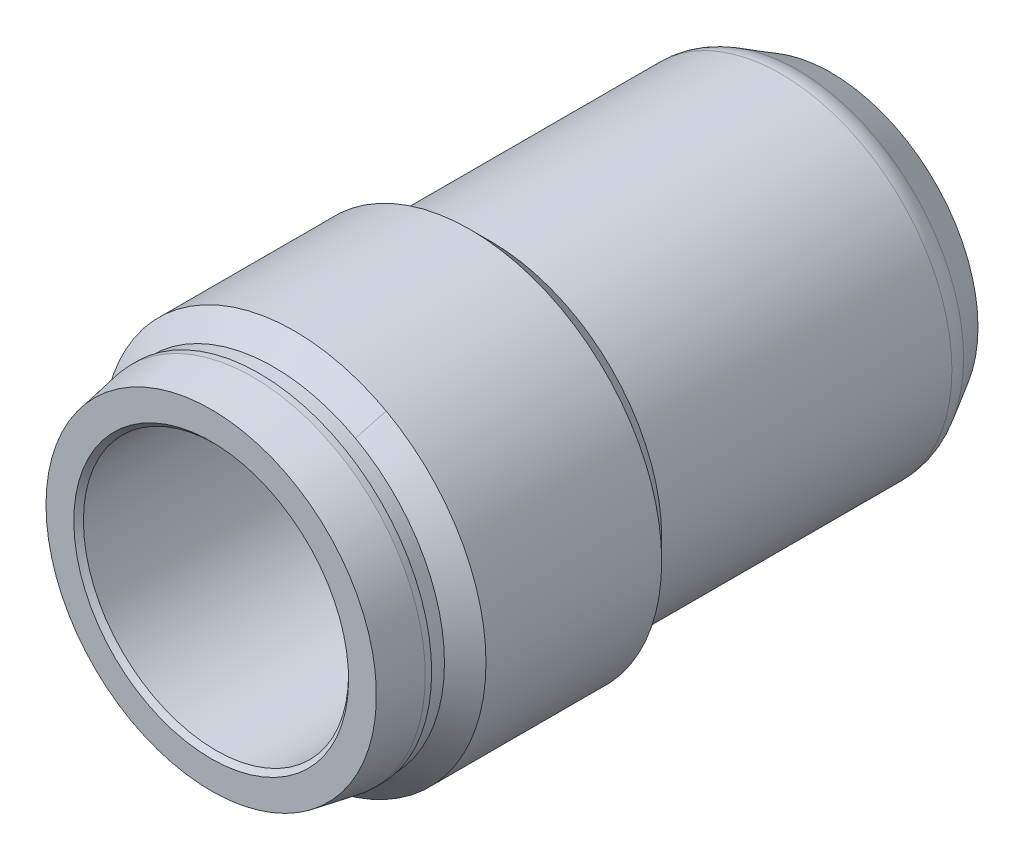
ISO-10303-21;
HEADER;
FILE_DESCRIPTION(('STEP AP214'),'2;1');
FILE_NAME('part.step','',(''),(''),'','','');
FILE_SCHEMA(('AUTOMOTIVE_DESIGN { 1 0 10303 214 1 1 1 1 }'));
ENDSEC;
DATA;
#1=APPLICATION_CONTEXT('core data for automotive mechanical design processes');
#2=APPLICATION_PROTOCOL_DEFINITION('international standard','automotive_design',2000,#1);
#3=PRODUCT_CONTEXT('',#1,'mechanical');
#4=PRODUCT('Part','Part','',(#3));
#5=PRODUCT_RELATED_PRODUCT_CATEGORY('part','',(#4));
#6=PRODUCT_DEFINITION_FORMATION('','',#4);
#7=PRODUCT_DEFINITION_CONTEXT('part definition',#1,'design');
#8=PRODUCT_DEFINITION('design','',#6,#7);
#9=PRODUCT_DEFINITION_SHAPE('','',#8);
#10=(LENGTH_UNIT() NAMED_UNIT(*) SI_UNIT(.MILLI.,.METRE.));
#11=(NAMED_UNIT(*) PLANE_ANGLE_UNIT() SI_UNIT($,.RADIAN.));
#12=(NAMED_UNIT(*) SI_UNIT($,.STERADIAN.) SOLID_ANGLE_UNIT());
#13=UNCERTAINTY_MEASURE_WITH_UNIT(LENGTH_MEASURE(1.E-05),#10,'distance_accuracy_value','');
#14=(GEOMETRIC_REPRESENTATION_CONTEXT(3) GLOBAL_UNCERTAINTY_ASSIGNED_CONTEXT((#13)) GLOBAL_UNIT_ASSIGNED_CONTEXT((#10,
#11,#12)) REPRESENTATION_CONTEXT('',''));
#15=CARTESIAN_POINT('',(0.,0.,0.));
#16=DIRECTION('',(0.,0.,1.));
#17=DIRECTION('',(1.,0.,0.));
#18=AXIS2_PLACEMENT_3D('',#15,#16,#17);
#19=CARTESIAN_POINT('',(0.,0.,39.3));
#20=DIRECTION('',(0.,0.,1.));
#21=DIRECTION('',(1.,0.,0.));
#22=AXIS2_PLACEMENT_3D('',#19,#20,#21);
#23=CYLINDRICAL_SURFACE('',#22,5.5);
#24=CARTESIAN_POINT('',(-5.47722557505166,0.5,32.5));
#25=CARTESIAN_POINT('',(-5.47722605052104,0.49999773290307,32.5280060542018));
#26=CARTESIAN_POINT('',(-5.47744277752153,0.497638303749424,32.5560359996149));
#27=CARTESIAN_POINT('',(-5.47828706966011,0.488253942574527,32.6113452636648));
#28=CARTESIAN_POINT('',(-5.47891550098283,0.481219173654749,32.6386228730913));
#29=CARTESIAN_POINT('',(-5.48051126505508,0.462690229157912,32.6915816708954));
#30=CARTESIAN_POINT('',(-5.4814782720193,0.451200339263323,32.7172643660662));
#31=CARTESIAN_POINT('',(-5.48364180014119,0.424094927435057,32.7663245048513));
#32=CARTESIAN_POINT('',(-5.48483821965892,0.408481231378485,32.7897029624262));
#33=CARTESIAN_POINT('',(-5.48733011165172,0.373517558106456,32.8335769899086));
#34=CARTESIAN_POINT('',(-5.48862585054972,0.354157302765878,32.8540643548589));
#35=CARTESIAN_POINT('',(-5.49116800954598,0.312271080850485,32.8915046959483));
#36=CARTESIAN_POINT('',(-5.49241442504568,0.289744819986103,32.9084573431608));
#37=CARTESIAN_POINT('',(-5.4947198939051,0.242119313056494,32.9383723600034));
#38=CARTESIAN_POINT('',(-5.49577862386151,0.217015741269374,32.9513278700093));
#39=CARTESIAN_POINT('',(-5.49758666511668,0.164978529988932,32.9728368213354));
#40=CARTESIAN_POINT('',(-5.49833598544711,0.138044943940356,32.9813903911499));
#41=CARTESIAN_POINT('',(-5.49943899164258,0.0831914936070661,32.9938298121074));
#42=CARTESIAN_POINT('',(-5.49979377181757,0.0552745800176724,32.9977285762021));
#43=CARTESIAN_POINT('',(-5.50007143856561,-0.000819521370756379,33.0007876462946));
#44=CARTESIAN_POINT('',(-5.49999433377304,-0.0289967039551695,32.9999480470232));
#45=CARTESIAN_POINT('',(-5.49941781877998,-0.0847235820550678,32.9935647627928));
#46=CARTESIAN_POINT('',(-5.49891965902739,-0.112274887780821,32.9880350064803));
#47=CARTESIAN_POINT('',(-5.49755847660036,-0.166056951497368,32.9724499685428));
#48=CARTESIAN_POINT('',(-5.49669544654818,-0.192287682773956,32.9623945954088));
#49=CARTESIAN_POINT('',(-5.49469940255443,-0.242728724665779,32.938027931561));
#50=CARTESIAN_POINT('',(-5.49356598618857,-0.26693595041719,32.9237102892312));
#51=CARTESIAN_POINT('',(-5.49115658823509,-0.312606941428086,32.8912314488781));
#52=CARTESIAN_POINT('',(-5.4898806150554,-0.33407086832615,32.8730704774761));
#53=CARTESIAN_POINT('',(-5.48732411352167,-0.37372596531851,32.8333455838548));
#54=CARTESIAN_POINT('',(-5.48604358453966,-0.39190566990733,32.8117702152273));
#55=CARTESIAN_POINT('',(-5.48362607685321,-0.42439545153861,32.7658563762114));
#56=CARTESIAN_POINT('',(-5.4824891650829,-0.438703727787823,32.7415166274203));
#57=CARTESIAN_POINT('',(-5.48048728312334,-0.463043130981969,32.6907478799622));
#58=CARTESIAN_POINT('',(-5.47962258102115,-0.473070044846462,32.6643168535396));
#59=CARTESIAN_POINT('',(-5.47826720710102,-0.488517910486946,32.6101801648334));
#60=CARTESIAN_POINT('',(-5.47777574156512,-0.493948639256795,32.5824773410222));
#61=CARTESIAN_POINT('',(-5.47731647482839,-0.49900539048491,32.5364280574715));
#62=CARTESIAN_POINT('',(-5.47722526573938,-0.500001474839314,32.5182190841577));
#63=CARTESIAN_POINT('',(-5.47722605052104,-0.49999773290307,32.4719939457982));
#64=CARTESIAN_POINT('',(-5.47744277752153,-0.497638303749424,32.4439640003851));
#65=CARTESIAN_POINT('',(-5.47828706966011,-0.488253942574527,32.3886547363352));
#66=CARTESIAN_POINT('',(-5.47891550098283,-0.481219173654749,32.3613771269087));
#67=CARTESIAN_POINT('',(-5.48051126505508,-0.462690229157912,32.3084183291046));
#68=CARTESIAN_POINT('',(-5.4814782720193,-0.451200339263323,32.2827356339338));
#69=CARTESIAN_POINT('',(-5.48364180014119,-0.424094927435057,32.2336754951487));
#70=CARTESIAN_POINT('',(-5.48483821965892,-0.408481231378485,32.2102970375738));
#71=CARTESIAN_POINT('',(-5.48733011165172,-0.373517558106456,32.1664230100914));
#72=CARTESIAN_POINT('',(-5.48862585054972,-0.354157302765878,32.1459356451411));
#73=CARTESIAN_POINT('',(-5.49116800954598,-0.312271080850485,32.1084953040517));
#74=CARTESIAN_POINT('',(-5.49241442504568,-0.289744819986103,32.0915426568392));
#75=CARTESIAN_POINT('',(-5.4947198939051,-0.242119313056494,32.0616276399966));
#76=CARTESIAN_POINT('',(-5.49577862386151,-0.217015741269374,32.0486721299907));
#77=CARTESIAN_POINT('',(-5.49758666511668,-0.164978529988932,32.0271631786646));
#78=CARTESIAN_POINT('',(-5.49833598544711,-0.138044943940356,32.0186096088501));
#79=CARTESIAN_POINT('',(-5.49943899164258,-0.083191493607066,32.0061701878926));
#80=CARTESIAN_POINT('',(-5.49979377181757,-0.0552745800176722,32.0022714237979));
#81=CARTESIAN_POINT('',(-5.50007143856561,0.000819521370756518,31.9992123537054));
#82=CARTESIAN_POINT('',(-5.49999433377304,0.0289967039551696,32.0000519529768));
#83=CARTESIAN_POINT('',(-5.49941781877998,0.0847235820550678,32.0064352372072));
#84=CARTESIAN_POINT('',(-5.49891965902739,0.112274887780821,32.0119649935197));
#85=CARTESIAN_POINT('',(-5.49755847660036,0.166056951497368,32.0275500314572));
#86=CARTESIAN_POINT('',(-5.49669544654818,0.192287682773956,32.0376054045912));
#87=CARTESIAN_POINT('',(-5.49469940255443,0.242728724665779,32.061972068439));
#88=CARTESIAN_POINT('',(-5.49356598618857,0.26693595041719,32.0762897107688));
#89=CARTESIAN_POINT('',(-5.49115658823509,0.312606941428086,32.1087685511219));
#90=CARTESIAN_POINT('',(-5.4898806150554,0.33407086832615,32.1269295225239));
#91=CARTESIAN_POINT('',(-5.48732411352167,0.37372596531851,32.1666544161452));
#92=CARTESIAN_POINT('',(-5.48604358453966,0.39190566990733,32.1882297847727));
#93=CARTESIAN_POINT('',(-5.48362607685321,0.42439545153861,32.2341436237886));
#94=CARTESIAN_POINT('',(-5.4824891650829,0.438703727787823,32.2584833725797));
#95=CARTESIAN_POINT('',(-5.48048728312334,0.463043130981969,32.3092521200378));
#96=CARTESIAN_POINT('',(-5.47962258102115,0.473070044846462,32.3356831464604));
#97=CARTESIAN_POINT('',(-5.47826720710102,0.488517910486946,32.3898198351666));
#98=CARTESIAN_POINT('',(-5.47777574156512,0.493948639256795,32.4175226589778));
#99=CARTESIAN_POINT('',(-5.47731647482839,0.49900539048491,32.4635719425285));
#100=CARTESIAN_POINT('',(-5.47722526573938,0.500001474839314,32.4817809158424));
#101=CARTESIAN_POINT('',(-5.47722557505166,0.5,32.5));
#102=B_SPLINE_CURVE_WITH_KNOTS('',3,(#24,#25,#26,#27,#28,#29,#30,#31,#32,#33,#34,#35,#36,#37,
#38,#39,#40,#41,#42,#43,#44,#45,#46,#47,#48,#49,#50,#51,#52,#53,#54,#55,#56,#57,#58,#59,#60,#61,
#62,#63,#64,#65,#66,#67,#68,#69,#70,#71,#72,#73,#74,#75,#76,#77,#78,#79,#80,#81,#82,#83,#84,#85,
#86,#87,#88,#89,#90,#91,#92,#93,#94,#95,#96,#97,#98,#99,#100,#101),.UNSPECIFIED.,.T.,.F.,(4,2,2,
2,2,2,2,2,2,2,2,2,2,2,2,2,2,2,2,2,2,2,2,2,2,2,2,2,2,2,2,2,2,2,2,2,2,2,4),(0.,0.0839603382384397,
0.168097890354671,0.25215470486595,0.336174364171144,0.420427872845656,0.504689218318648,
0.58909437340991,0.673497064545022,0.757665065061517,0.841831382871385,0.925748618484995,
1.00966755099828,1.09371217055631,1.17775183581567,1.26207944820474,1.34644621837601,
1.43089581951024,1.51516532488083,1.56978496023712,1.65374529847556,1.73788285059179,
1.82193966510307,1.90595932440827,1.99021283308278,2.07447417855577,2.15887933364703,
2.24328202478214,2.32745002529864,2.41161634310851,2.49553357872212,2.57945251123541,
2.66349713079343,2.74753679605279,2.83186440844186,2.91623117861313,3.00068077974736,
3.08495028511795,3.13956992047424),.UNSPECIFIED.);
#103=CARTESIAN_POINT('',(-5.47722557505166,0.5,32.5));
#104=VERTEX_POINT('',#103);
#105=EDGE_CURVE('E21',#104,#104,#102,.T.);
#106=ORIENTED_EDGE('',*,*,#105,.F.);
#107=EDGE_LOOP('',(#106));
#108=FACE_BOUND('',#107,.T.);
#109=ADVANCED_FACE('F17',(#108),#23,.T.);
#110=CARTESIAN_POINT('',(0.,0.,40.8999999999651));
#111=DIRECTION('',(0.,0.,1.));
#112=DIRECTION('',(1.,0.,0.));
#113=AXIS2_PLACEMENT_3D('',#110,#111,#112);
#114=CONICAL_SURFACE('',#113,5.99999999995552,0.785398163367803);
#115=CARTESIAN_POINT('',(0.,0.,40.25));
#116=DIRECTION('',(0.,0.,1.));
#117=DIRECTION('',(1.,0.,0.));
#118=AXIS2_PLACEMENT_3D('',#115,#116,#117);
#119=CIRCLE('',#118,5.35);
#120=CARTESIAN_POINT('',(5.35,0.,40.25));
#121=VERTEX_POINT('',#120);
#122=EDGE_CURVE('E89',#121,#121,#119,.F.);
#123=ORIENTED_EDGE('',*,*,#122,.F.);
#124=EDGE_LOOP('',(#123));
#125=FACE_BOUND('',#124,.T.);
#126=CARTESIAN_POINT('',(0.,0.,40.9));
#127=DIRECTION('',(0.,0.,1.));
#128=DIRECTION('',(1.,0.,0.));
#129=AXIS2_PLACEMENT_3D('',#126,#127,#128);
#130=CIRCLE('',#129,6.);
#131=CARTESIAN_POINT('',(6.,0.,40.9));
#132=VERTEX_POINT('',#131);
#133=EDGE_CURVE('E85',#132,#132,#130,.T.);
#134=ORIENTED_EDGE('',*,*,#133,.F.);
#135=EDGE_LOOP('',(#134));
#136=FACE_BOUND('',#135,.T.);
#137=ADVANCED_FACE('F150',(#125,#136),#114,.T.);
#138=CARTESIAN_POINT('',(-3.66000000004,0.,32.5));
#139=DIRECTION('',(-1.,0.,0.));
#140=DIRECTION('',(0.,0.,1.));
#141=AXIS2_PLACEMENT_3D('',#138,#139,#140);
#142=CYLINDRICAL_SURFACE('',#141,0.5);
#143=ORIENTED_EDGE('',*,*,#105,.T.);
#144=EDGE_LOOP('',(#143));
#145=FACE_BOUND('',#144,.T.);
#146=CARTESIAN_POINT('',(-5.32658427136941,0.5,32.5));
#147=CARTESIAN_POINT('',(-5.32658475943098,0.49999773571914,32.5280024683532));
#148=CARTESIAN_POINT('',(-5.32680755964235,0.497638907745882,32.5560287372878));
#149=CARTESIAN_POINT('',(-5.32767549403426,0.488257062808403,32.6113305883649));
#150=CARTESIAN_POINT('',(-5.32832151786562,0.481224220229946,32.6386044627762));
#151=CARTESIAN_POINT('',(-5.32996191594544,0.462700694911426,32.6915557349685));
#152=CARTESIAN_POINT('',(-5.33095595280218,0.451214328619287,32.7172346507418));
#153=CARTESIAN_POINT('',(-5.33317992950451,0.424117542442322,32.7662879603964));
#154=CARTESIAN_POINT('',(-5.33440976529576,0.408508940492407,32.7896633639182));
#155=CARTESIAN_POINT('',(-5.33697146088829,0.373554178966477,32.8335358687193));
#156=CARTESIAN_POINT('',(-5.33830360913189,0.354197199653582,32.8540243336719));
#157=CARTESIAN_POINT('',(-5.34091725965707,0.312317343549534,32.89146769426));
#158=CARTESIAN_POINT('',(-5.34219875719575,0.289794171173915,32.908422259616));
#159=CARTESIAN_POINT('',(-5.34456933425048,0.242171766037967,32.9383434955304));
#160=CARTESIAN_POINT('',(-5.34565806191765,0.217067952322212,32.9513029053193));
#161=CARTESIAN_POINT('',(-5.34751742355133,0.165028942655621,32.9728193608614));
#162=CARTESIAN_POINT('',(-5.34828806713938,0.138093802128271,32.9813765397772));
#163=CARTESIAN_POINT('',(-5.34942248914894,0.0832404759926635,32.9938214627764));
#164=CARTESIAN_POINT('',(-5.34978745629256,0.0553254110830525,32.9977228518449));
#165=CARTESIAN_POINT('',(-5.350073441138,-0.000765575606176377,33.0007876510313));
#166=CARTESIAN_POINT('',(-5.34999446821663,-0.0289414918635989,32.9999511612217));
#167=CARTESIAN_POINT('',(-5.34940244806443,-0.0846614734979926,32.9935750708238));
#168=CARTESIAN_POINT('',(-5.34889075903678,-0.112207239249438,32.9880501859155));
#169=CARTESIAN_POINT('',(-5.34749238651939,-0.165979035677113,32.9724769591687));
#170=CARTESIAN_POINT('',(-5.34660569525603,-0.192205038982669,32.9624285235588));
#171=CARTESIAN_POINT('',(-5.34455466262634,-0.242639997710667,32.9380767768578));
#172=CARTESIAN_POINT('',(-5.34338988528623,-0.266845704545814,32.9237667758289));
#173=CARTESIAN_POINT('',(-5.34091359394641,-0.312515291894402,32.8913042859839));
#174=CARTESIAN_POINT('',(-5.33960208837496,-0.333979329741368,32.8731520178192));
#175=CARTESIAN_POINT('',(-5.33697384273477,-0.373640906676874,32.8334409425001));
#176=CARTESIAN_POINT('',(-5.33565710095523,-0.39182629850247,32.8118700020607));
#177=CARTESIAN_POINT('',(-5.33317093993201,-0.424328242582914,32.7659636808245));
#178=CARTESIAN_POINT('',(-5.33200158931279,-0.43864299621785,32.7416270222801));
#179=CARTESIAN_POINT('',(-5.32994228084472,-0.462996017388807,32.690862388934));
#180=CARTESIAN_POINT('',(-5.32905260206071,-0.473030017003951,32.6644323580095));
#181=CARTESIAN_POINT('',(-5.32765775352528,-0.488491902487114,32.610295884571));
#182=CARTESIAN_POINT('',(-5.32715176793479,-0.493929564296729,32.5825922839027));
#183=CARTESIAN_POINT('',(-5.32667813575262,-0.499001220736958,32.5365041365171));
#184=CARTESIAN_POINT('',(-5.3265839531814,-0.500001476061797,32.5182571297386));
#185=CARTESIAN_POINT('',(-5.32658475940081,-0.499997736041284,32.4719975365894));
#186=CARTESIAN_POINT('',(-5.32680755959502,-0.497638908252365,32.4439712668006));
#187=CARTESIAN_POINT('',(-5.32767549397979,-0.488257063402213,32.3886694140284));
#188=CARTESIAN_POINT('',(-5.32832151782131,-0.481224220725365,32.3613955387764));
#189=CARTESIAN_POINT('',(-5.32996191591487,-0.46270069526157,32.3084442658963));
#190=CARTESIAN_POINT('',(-5.33095595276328,-0.451214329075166,32.282765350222));
#191=CARTESIAN_POINT('',(-5.33317992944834,-0.424117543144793,32.2337120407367));
#192=CARTESIAN_POINT('',(-5.33440976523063,-0.408508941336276,32.2103366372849));
#193=CARTESIAN_POINT('',(-5.33697146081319,-0.373554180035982,32.1664641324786));
#194=CARTESIAN_POINT('',(-5.33830360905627,-0.35419720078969,32.1459756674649));
#195=CARTESIAN_POINT('',(-5.34091725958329,-0.312317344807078,32.1085323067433));
#196=CARTESIAN_POINT('',(-5.34219875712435,-0.289794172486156,32.0915777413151));
#197=CARTESIAN_POINT('',(-5.34456933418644,-0.242171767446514,32.0616565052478));
#198=CARTESIAN_POINT('',(-5.3456580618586,-0.217067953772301,32.0486970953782));
#199=CARTESIAN_POINT('',(-5.34751742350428,-0.165028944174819,32.0271806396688));
#200=CARTESIAN_POINT('',(-5.34828806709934,-0.138093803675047,32.0186234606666));
#201=CARTESIAN_POINT('',(-5.34942248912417,-0.0832404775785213,32.0061785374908));
#202=CARTESIAN_POINT('',(-5.34978745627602,-0.0553254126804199,32.0022771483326));
#203=CARTESIAN_POINT('',(-5.35007344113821,0.000765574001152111,31.9992123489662));
#204=CARTESIAN_POINT('',(-5.34999446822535,0.0289414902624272,32.0000488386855));
#205=CARTESIAN_POINT('',(-5.34940244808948,0.0846614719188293,32.0064249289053));
#206=CARTESIAN_POINT('',(-5.34889075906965,0.1122072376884,32.0119498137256));
#207=CARTESIAN_POINT('',(-5.3474923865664,0.165979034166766,32.0275230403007));
#208=CARTESIAN_POINT('',(-5.34660569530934,0.192205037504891,32.037571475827));
#209=CARTESIAN_POINT('',(-5.34455466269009,0.242639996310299,32.0619232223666));
#210=CARTESIAN_POINT('',(-5.34338988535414,0.266845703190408,32.0762332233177));
#211=CARTESIAN_POINT('',(-5.34091359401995,0.31251529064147,32.1086957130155));
#212=CARTESIAN_POINT('',(-5.33960208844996,0.333979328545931,32.1268479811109));
#213=CARTESIAN_POINT('',(-5.33697384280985,0.373640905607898,32.1665590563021));
#214=CARTESIAN_POINT('',(-5.33565710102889,0.391826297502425,32.1881299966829));
#215=CARTESIAN_POINT('',(-5.33317094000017,0.424328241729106,32.2340363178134));
#216=CARTESIAN_POINT('',(-5.33200158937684,0.438642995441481,32.2583729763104));
#217=CARTESIAN_POINT('',(-5.32994228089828,0.462996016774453,32.3091376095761));
#218=CARTESIAN_POINT('',(-5.32905260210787,0.473030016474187,32.3355676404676));
#219=CARTESIAN_POINT('',(-5.32765775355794,0.488491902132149,32.3897041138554));
#220=CARTESIAN_POINT('',(-5.3271517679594,0.493929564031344,32.4174077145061));
#221=CARTESIAN_POINT('',(-5.32667813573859,0.499001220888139,32.4634958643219));
#222=CARTESIAN_POINT('',(-5.32658395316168,0.500001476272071,32.4817428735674));
#223=CARTESIAN_POINT('',(-5.32658427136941,0.5,32.5));
#224=B_SPLINE_CURVE_WITH_KNOTS('',3,(#146,#147,#148,#149,#150,#151,#152,#153,#154,#155,#156,
#157,#158,#159,#160,#161,#162,#163,#164,#165,#166,#167,#168,#169,#170,#171,#172,#173,#174,#175,
#176,#177,#178,#179,#180,#181,#182,#183,#184,#185,#186,#187,#188,#189,#190,#191,#192,#193,#194,
#195,#196,#197,#198,#199,#200,#201,#202,#203,#204,#205,#206,#207,#208,#209,#210,#211,#212,#213,
#214,#215,#216,#217,#218,#219,#220,#221,#222,#223),.UNSPECIFIED.,.T.,.F.,(4,2,2,2,2,2,2,2,2,2,2,
2,2,2,2,2,2,2,2,2,2,2,2,2,2,2,2,2,2,2,2,2,2,2,2,2,2,2,4),(0.,0.0839494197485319,
0.168075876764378,0.252120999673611,0.336129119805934,0.420383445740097,0.50464564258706,
0.589060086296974,0.67347197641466,0.757635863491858,0.84179797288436,0.925696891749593,
1.00959754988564,1.09363061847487,1.17765886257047,1.26199230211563,1.34636486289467,
1.43082134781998,1.51509774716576,1.56983131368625,1.65378073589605,1.73790719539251,
1.82195231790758,1.90596043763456,1.99021476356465,2.07447696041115,2.15889140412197,
2.24330329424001,2.32746718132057,2.41162929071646,2.49552820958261,2.57942886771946,
2.66346193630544,2.74749018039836,2.83182361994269,2.91619618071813,3.00065266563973,
3.08492906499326,3.13966263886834),.UNSPECIFIED.);
#225=CARTESIAN_POINT('',(-5.32658427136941,0.5,32.5));
#226=VERTEX_POINT('',#225);
#227=EDGE_CURVE('E59',#226,#226,#224,.T.);
#228=ORIENTED_EDGE('',*,*,#227,.F.);
#229=EDGE_LOOP('',(#228));
#230=FACE_BOUND('',#229,.T.);
#231=ADVANCED_FACE('F136',(#145,#230),#142,.T.);
#232=CARTESIAN_POINT('',(0.,0.,39.3));
#233=DIRECTION('',(0.,0.,1.));
#234=DIRECTION('',(1.,0.,0.));
#235=AXIS2_PLACEMENT_3D('',#232,#233,#234);
#236=CYLINDRICAL_SURFACE('',#235,6.);
#237=CARTESIAN_POINT('',(0.,0.,46.3999999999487));
#238=DIRECTION('',(0.,0.,-1.));
#239=DIRECTION('',(0.47942553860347,0.877582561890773,0.));
#240=AXIS2_PLACEMENT_3D('',#237,#238,#239);
#241=CIRCLE('',#240,6.00000000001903);
#242=CARTESIAN_POINT('',(2.876553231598,5.26549537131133,46.4000000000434));
#243=VERTEX_POINT('',#242);
#244=CARTESIAN_POINT('',(-2.87655323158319,-5.26549537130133,46.4000000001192));
#245=VERTEX_POINT('',#244);
#246=EDGE_CURVE('E49',#243,#245,#241,.F.);
#247=ORIENTED_EDGE('',*,*,#246,.F.);
#248=CARTESIAN_POINT('',(0.,0.,46.4000000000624));
#249=DIRECTION('',(0.,0.,-1.));
#250=DIRECTION('',(0.479425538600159,0.877582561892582,0.));
#251=AXIS2_PLACEMENT_3D('',#248,#249,#250);
#252=CIRCLE('',#251,5.99999999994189);
#253=EDGE_CURVE('E56',#245,#243,#252,.F.);
#254=ORIENTED_EDGE('',*,*,#253,.F.);
#255=EDGE_LOOP('',(#247,#254));
#256=FACE_BOUND('',#255,.T.);
#257=ORIENTED_EDGE('',*,*,#133,.T.);
#258=EDGE_LOOP('',(#257));
#259=FACE_BOUND('',#258,.T.);
#260=ADVANCED_FACE('F54',(#256,#259),#236,.T.);
#261=CARTESIAN_POINT('',(0.,0.,39.3));
#262=DIRECTION('',(0.,0.,1.));
#263=DIRECTION('',(1.,0.,0.));
#264=AXIS2_PLACEMENT_3D('',#261,#262,#263);
#265=CYLINDRICAL_SURFACE('',#264,5.35);
#266=CARTESIAN_POINT('',(0.,0.,31.1669872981));
#267=DIRECTION('',(0.,0.,1.));
#268=DIRECTION('',(0.479425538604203,0.877582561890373,0.));
#269=AXIS2_PLACEMENT_3D('',#266,#267,#268);
#270=CIRCLE('',#269,5.35);
#271=CARTESIAN_POINT('',(2.56492663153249,4.69506670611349,31.1669872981));
#272=VERTEX_POINT('',#271);
#273=EDGE_CURVE('E66',#272,#272,#270,.F.);
#274=ORIENTED_EDGE('',*,*,#273,.F.);
#275=EDGE_LOOP('',(#274));
#276=FACE_BOUND('',#275,.T.);
#277=ORIENTED_EDGE('',*,*,#227,.T.);
#278=EDGE_LOOP('',(#277));
#279=FACE_BOUND('',#278,.T.);
#280=ORIENTED_EDGE('',*,*,#122,.T.);
#281=EDGE_LOOP('',(#280));
#282=FACE_BOUND('',#281,.T.);
#283=ADVANCED_FACE('F139',(#276,#279,#282),#265,.T.);
#284=CARTESIAN_POINT('',(0.,0.,46.4000000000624));
#285=DIRECTION('',(0.,0.,-1.));
#286=DIRECTION('',(-1.,0.,0.));
#287=AXIS2_PLACEMENT_3D('',#284,#285,#286);
#288=CONICAL_SURFACE('',#287,5.99999999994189,0.785398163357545);
#289=DIRECTION('',(0.339005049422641,0.620544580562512,0.707106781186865));
#290=VECTOR('',#289,1.);
#291=CARTESIAN_POINT('',(-239258.46566274,-437959.683708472,-499000.));
#292=LINE('',#291,#290);
#293=CARTESIAN_POINT('',(-2.56492663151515,-4.69506670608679,47.0500000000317));
#294=VERTEX_POINT('',#293);
#295=EDGE_CURVE('E64',#294,#245,#292,.F.);
#296=ORIENTED_EDGE('',*,*,#295,.F.);
#297=CARTESIAN_POINT('',(0.,0.,47.05));
#298=DIRECTION('',(0.,0.,1.));
#299=DIRECTION('',(1.,0.,0.));
#300=AXIS2_PLACEMENT_3D('',#297,#298,#299);
#301=CIRCLE('',#300,5.35);
#302=CARTESIAN_POINT('',(2.56492663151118,4.69506670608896,47.0500000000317));
#303=VERTEX_POINT('',#302);
#304=EDGE_CURVE('E40',#303,#294,#301,.T.);
#305=ORIENTED_EDGE('',*,*,#304,.F.);
#306=DIRECTION('',(-0.339005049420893,-0.620544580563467,0.707106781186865));
#307=VECTOR('',#306,1.);
#308=CARTESIAN_POINT('',(239258.465661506,437959.683709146,-499000.));
#309=LINE('',#308,#307);
#310=EDGE_CURVE('E58',#243,#303,#309,.T.);
#311=ORIENTED_EDGE('',*,*,#310,.F.);
#312=ORIENTED_EDGE('',*,*,#246,.T.);
#313=EDGE_LOOP('',(#296,#305,#311,#312));
#314=FACE_BOUND('',#313,.T.);
#315=ADVANCED_FACE('F68',(#314),#288,.T.);
#316=CARTESIAN_POINT('',(0.,0.,46.4000000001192));
#317=DIRECTION('',(0.,0.,-1.));
#318=DIRECTION('',(-1.,0.,0.));
#319=AXIS2_PLACEMENT_3D('',#316,#317,#318);
#320=CONICAL_SURFACE('',#319,5.99999999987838,0.785398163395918);
#321=ORIENTED_EDGE('',*,*,#295,.T.);
#322=ORIENTED_EDGE('',*,*,#253,.T.);
#323=ORIENTED_EDGE('',*,*,#310,.T.);
#324=CARTESIAN_POINT('',(0.,0.,47.05));
#325=DIRECTION('',(0.,0.,1.));
#326=DIRECTION('',(1.,0.,0.));
#327=AXIS2_PLACEMENT_3D('',#324,#325,#326);
#328=CIRCLE('',#327,5.35);
#329=EDGE_CURVE('E222',#294,#303,#328,.T.);
#330=ORIENTED_EDGE('',*,*,#329,.F.);
#331=EDGE_LOOP('',(#321,#322,#323,#330));
#332=FACE_BOUND('',#331,.T.);
#333=ADVANCED_FACE('F62',(#332),#320,.T.);
#334=CARTESIAN_POINT('',(0.,0.,31.1669872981));
#335=DIRECTION('',(0.,0.,1.));
#336=DIRECTION('',(0.479425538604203,0.877582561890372,0.));
#337=AXIS2_PLACEMENT_3D('',#334,#335,#336);
#338=TOROIDAL_SURFACE('',#337,4.35,1.);
#339=ORIENTED_EDGE('',*,*,#273,.T.);
#340=EDGE_LOOP('',(#339));
#341=FACE_BOUND('',#340,.T.);
#342=CARTESIAN_POINT('',(0.,0.,30.6669872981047));
#343=DIRECTION('',(0.,0.,1.));
#344=DIRECTION('',(0.479425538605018,0.877582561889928,0.));
#345=AXIS2_PLACEMENT_3D('',#342,#343,#344);
#346=CIRCLE('',#345,5.21602540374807);
#347=CARTESIAN_POINT('',(2.50069578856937,4.57749293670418,30.6669872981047));
#348=VERTEX_POINT('',#347);
#349=EDGE_CURVE('E129',#348,#348,#346,.F.);
#350=ORIENTED_EDGE('',*,*,#349,.F.);
#351=EDGE_LOOP('',(#350));
#352=FACE_BOUND('',#351,.T.);
#353=ADVANCED_FACE('F208',(#341,#352),#338,.T.);
#354=CARTESIAN_POINT('',(0.,0.,39.3));
#355=DIRECTION('',(0.,0.,1.));
#356=DIRECTION('',(1.,0.,0.));
#357=AXIS2_PLACEMENT_3D('',#354,#355,#356);
#358=CYLINDRICAL_SURFACE('',#357,5.35);
#359=CARTESIAN_POINT('',(0.,0.,47.5));
#360=DIRECTION('',(0.,0.,1.));
#361=DIRECTION('',(1.,0.,0.));
#362=AXIS2_PLACEMENT_3D('',#359,#360,#361);
#363=CIRCLE('',#362,5.35);
#364=CARTESIAN_POINT('',(5.35,0.,47.5));
#365=VERTEX_POINT('',#364);
#366=EDGE_CURVE('E126',#365,#365,#363,.T.);
#367=ORIENTED_EDGE('',*,*,#366,.F.);
#368=EDGE_LOOP('',(#367));
#369=FACE_BOUND('',#368,.T.);
#370=ORIENTED_EDGE('',*,*,#329,.T.);
#371=ORIENTED_EDGE('',*,*,#304,.T.);
#372=EDGE_LOOP('',(#370,#371));
#373=FACE_BOUND('',#372,.T.);
#374=ADVANCED_FACE('F204',(#369,#373),#358,.T.);
#375=CARTESIAN_POINT('',(0.,0.,30.666987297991));
#376=DIRECTION('',(0.,0.,1.));
#377=DIRECTION('',(1.,0.,0.));
#378=AXIS2_PLACEMENT_3D('',#375,#376,#377);
#379=CONICAL_SURFACE('',#378,5.21602540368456,0.523598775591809);
#380=ORIENTED_EDGE('',*,*,#349,.T.);
#381=EDGE_LOOP('',(#380));
#382=FACE_BOUND('',#381,.T.);
#383=CARTESIAN_POINT('',(0.,0.,29.6000000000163));
#384=DIRECTION('',(0.,0.,1.));
#385=DIRECTION('',(1.,0.,0.));
#386=AXIS2_PLACEMENT_3D('',#383,#384,#385);
#387=CIRCLE('',#386,4.59999999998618);
#388=CARTESIAN_POINT('',(4.59999999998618,0.,29.6000000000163));
#389=VERTEX_POINT('',#388);
#390=EDGE_CURVE('E122',#389,#389,#387,.F.);
#391=ORIENTED_EDGE('',*,*,#390,.F.);
#392=EDGE_LOOP('',(#391));
#393=FACE_BOUND('',#392,.T.);
#394=ADVANCED_FACE('F200',(#382,#393),#379,.T.);
#395=CARTESIAN_POINT('',(0.,5.35,47.5));
#396=DIRECTION('',(0.,0.,-1.));
#397=DIRECTION('',(-1.,0.,0.));
#398=AXIS2_PLACEMENT_3D('',#395,#396,#397);
#399=PLANE('',#398);
#400=ORIENTED_EDGE('',*,*,#366,.T.);
#401=EDGE_LOOP('',(#400));
#402=FACE_BOUND('',#401,.T.);
#403=CARTESIAN_POINT('',(0.,0.,47.5));
#404=DIRECTION('',(0.,0.,1.));
#405=DIRECTION('',(1.,0.,0.));
#406=AXIS2_PLACEMENT_3D('',#403,#404,#405);
#407=CIRCLE('',#406,5.4);
#408=CARTESIAN_POINT('',(5.4,0.,47.5));
#409=VERTEX_POINT('',#408);
#410=EDGE_CURVE('E118',#409,#409,#407,.T.);
#411=ORIENTED_EDGE('',*,*,#410,.F.);
#412=EDGE_LOOP('',(#411));
#413=FACE_BOUND('',#412,.T.);
#414=ADVANCED_FACE('F196',(#402,#413),#399,.T.);
#415=CARTESIAN_POINT('',(0.,4.6,29.6));
#416=DIRECTION('',(0.,0.,-1.));
#417=DIRECTION('',(-1.,0.,0.));
#418=AXIS2_PLACEMENT_3D('',#415,#416,#417);
#419=PLANE('',#418);
#420=CARTESIAN_POINT('',(0.,0.,29.6));
#421=DIRECTION('',(0.,0.,1.));
#422=DIRECTION('',(1.,0.,0.));
#423=AXIS2_PLACEMENT_3D('',#420,#421,#422);
#424=CIRCLE('',#423,3.56);
#425=CARTESIAN_POINT('',(3.56,0.,29.6));
#426=VERTEX_POINT('',#425);
#427=EDGE_CURVE('E114',#426,#426,#424,.T.);
#428=ORIENTED_EDGE('',*,*,#427,.T.);
#429=EDGE_LOOP('',(#428));
#430=FACE_BOUND('',#429,.T.);
#431=ORIENTED_EDGE('',*,*,#390,.T.);
#432=EDGE_LOOP('',(#431));
#433=FACE_BOUND('',#432,.T.);
#434=ADVANCED_FACE('F192',(#430,#433),#419,.T.);
#435=CARTESIAN_POINT('',(0.,0.,39.3));
#436=DIRECTION('',(0.,0.,1.));
#437=DIRECTION('',(1.,0.,0.));
#438=AXIS2_PLACEMENT_3D('',#435,#436,#437);
#439=CYLINDRICAL_SURFACE('',#438,5.4);
#440=CARTESIAN_POINT('',(0.,0.,47.7000000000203));
#441=DIRECTION('',(0.,0.,-1.));
#442=DIRECTION('',(0.479425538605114,0.877582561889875,0.));
#443=AXIS2_PLACEMENT_3D('',#440,#441,#442);
#444=CIRCLE('',#443,5.39999999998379);
#445=CARTESIAN_POINT('',(2.58889790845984,4.7389458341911,47.7000000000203));
#446=VERTEX_POINT('',#445);
#447=EDGE_CURVE('E113',#446,#446,#444,.F.);
#448=ORIENTED_EDGE('',*,*,#447,.F.);
#449=EDGE_LOOP('',(#448));
#450=FACE_BOUND('',#449,.T.);
#451=ORIENTED_EDGE('',*,*,#410,.T.);
#452=EDGE_LOOP('',(#451));
#453=FACE_BOUND('',#452,.T.);
#454=ADVANCED_FACE('F188',(#450,#453),#439,.T.);
#455=CARTESIAN_POINT('',(0.,0.,39.3));
#456=DIRECTION('',(0.,0.,1.));
#457=DIRECTION('',(1.,0.,0.));
#458=AXIS2_PLACEMENT_3D('',#455,#456,#457);
#459=CYLINDRICAL_SURFACE('',#458,3.56);
#460=ORIENTED_EDGE('',*,*,#427,.F.);
#461=EDGE_LOOP('',(#460));
#462=FACE_BOUND('',#461,.T.);
#463=CARTESIAN_POINT('',(0.,0.,34.8));
#464=DIRECTION('',(0.,0.,1.));
#465=DIRECTION('',(1.,0.,0.));
#466=AXIS2_PLACEMENT_3D('',#463,#464,#465);
#467=CIRCLE('',#466,3.56);
#468=CARTESIAN_POINT('',(3.56,0.,34.8));
#469=VERTEX_POINT('',#468);
#470=EDGE_CURVE('E109',#469,#469,#467,.T.);
#471=ORIENTED_EDGE('',*,*,#470,.T.);
#472=EDGE_LOOP('',(#471));
#473=FACE_BOUND('',#472,.T.);
#474=ADVANCED_FACE('F184',(#462,#473),#459,.F.);
#475=CARTESIAN_POINT('',(0.,0.,47.7000000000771));
#476=DIRECTION('',(0.,0.,-1.));
#477=DIRECTION('',(-1.,0.,0.));
#478=AXIS2_PLACEMENT_3D('',#475,#476,#477);
#479=CONICAL_SURFACE('',#478,5.39999999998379,0.174532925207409);
#480=CARTESIAN_POINT('',(0.,0.,48.9999999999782));
#481=DIRECTION('',(0.,0.,-1.));
#482=DIRECTION('',(-1.,0.,0.));
#483=AXIS2_PLACEMENT_3D('',#480,#481,#482);
#484=CIRCLE('',#483,5.17077492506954);
#485=CARTESIAN_POINT('',(-5.17077492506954,0.,48.9999999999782));
#486=VERTEX_POINT('',#485);
#487=EDGE_CURVE('E105',#486,#486,#484,.T.);
#488=ORIENTED_EDGE('',*,*,#487,.T.);
#489=EDGE_LOOP('',(#488));
#490=FACE_BOUND('',#489,.T.);
#491=ORIENTED_EDGE('',*,*,#447,.T.);
#492=EDGE_LOOP('',(#491));
#493=FACE_BOUND('',#492,.T.);
#494=ADVANCED_FACE('F180',(#490,#493),#479,.T.);
#495=CARTESIAN_POINT('',(0.,3.9,34.8));
#496=DIRECTION('',(0.,0.,-1.));
#497=DIRECTION('',(-1.,0.,0.));
#498=AXIS2_PLACEMENT_3D('',#495,#496,#497);
#499=PLANE('',#498);
#500=ORIENTED_EDGE('',*,*,#470,.F.);
#501=EDGE_LOOP('',(#500));
#502=FACE_BOUND('',#501,.T.);
#503=CARTESIAN_POINT('',(0.,0.,34.8));
#504=DIRECTION('',(0.,0.,1.));
#505=DIRECTION('',(1.,0.,0.));
#506=AXIS2_PLACEMENT_3D('',#503,#504,#505);
#507=CIRCLE('',#506,3.9);
#508=CARTESIAN_POINT('',(3.9,0.,34.8));
#509=VERTEX_POINT('',#508);
#510=EDGE_CURVE('E101',#509,#509,#507,.T.);
#511=ORIENTED_EDGE('',*,*,#510,.T.);
#512=EDGE_LOOP('',(#511));
#513=FACE_BOUND('',#512,.T.);
#514=ADVANCED_FACE('F176',(#502,#513),#499,.F.);
#515=CARTESIAN_POINT('',(0.,5.17077492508,49.));
#516=DIRECTION('',(0.,0.,-1.));
#517=DIRECTION('',(-1.,0.,0.));
#518=AXIS2_PLACEMENT_3D('',#515,#516,#517);
#519=PLANE('',#518);
#520=CARTESIAN_POINT('',(0.,0.,48.9999999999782));
#521=DIRECTION('',(0.,0.,1.));
#522=DIRECTION('',(0.,-1.,0.));
#523=AXIS2_PLACEMENT_3D('',#520,#521,#522);
#524=CIRCLE('',#523,4.29999999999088);
#525=CARTESIAN_POINT('',(0.,-4.29999999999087,48.9999999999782));
#526=VERTEX_POINT('',#525);
#527=EDGE_CURVE('E97',#526,#526,#524,.F.);
#528=ORIENTED_EDGE('',*,*,#527,.T.);
#529=EDGE_LOOP('',(#528));
#530=FACE_BOUND('',#529,.T.);
#531=ORIENTED_EDGE('',*,*,#487,.F.);
#532=EDGE_LOOP('',(#531));
#533=FACE_BOUND('',#532,.T.);
#534=ADVANCED_FACE('F172',(#530,#533),#519,.F.);
#535=CARTESIAN_POINT('',(0.,0.,39.3));
#536=DIRECTION('',(0.,0.,1.));
#537=DIRECTION('',(1.,0.,0.));
#538=AXIS2_PLACEMENT_3D('',#535,#536,#537);
#539=CYLINDRICAL_SURFACE('',#538,3.9);
#540=CARTESIAN_POINT('',(0.,0.,36.8));
#541=DIRECTION('',(0.,0.,1.));
#542=DIRECTION('',(1.,0.,0.));
#543=AXIS2_PLACEMENT_3D('',#540,#541,#542);
#544=CIRCLE('',#543,3.9);
#545=CARTESIAN_POINT('',(3.9,0.,36.8));
#546=VERTEX_POINT('',#545);
#547=EDGE_CURVE('E93',#546,#546,#544,.T.);
#548=ORIENTED_EDGE('',*,*,#547,.T.);
#549=EDGE_LOOP('',(#548));
#550=FACE_BOUND('',#549,.T.);
#551=ORIENTED_EDGE('',*,*,#510,.F.);
#552=EDGE_LOOP('',(#551));
#553=FACE_BOUND('',#552,.T.);
#554=ADVANCED_FACE('F168',(#550,#553),#539,.F.);
#555=CARTESIAN_POINT('',(0.,0.,48.9999999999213));
#556=DIRECTION('',(0.,0.,1.));
#557=DIRECTION('',(0.,-1.,0.));
#558=AXIS2_PLACEMENT_3D('',#555,#556,#557);
#559=CONICAL_SURFACE('',#558,4.29999999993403,0.785398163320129);
#560=CARTESIAN_POINT('',(0.,0.,48.85));
#561=DIRECTION('',(0.,0.,1.));
#562=DIRECTION('',(1.,0.,0.));
#563=AXIS2_PLACEMENT_3D('',#560,#561,#562);
#564=CIRCLE('',#563,4.15);
#565=CARTESIAN_POINT('',(4.15,0.,48.85));
#566=VERTEX_POINT('',#565);
#567=EDGE_CURVE('E32',#566,#566,#564,.F.);
#568=ORIENTED_EDGE('',*,*,#567,.T.);
#569=EDGE_LOOP('',(#568));
#570=FACE_BOUND('',#569,.T.);
#571=ORIENTED_EDGE('',*,*,#527,.F.);
#572=EDGE_LOOP('',(#571));
#573=FACE_BOUND('',#572,.T.);
#574=ADVANCED_FACE('F160',(#570,#573),#559,.F.);
#575=CARTESIAN_POINT('',(0.,3.9,36.8));
#576=DIRECTION('',(0.,0.,-1.));
#577=DIRECTION('',(-1.,0.,0.));
#578=AXIS2_PLACEMENT_3D('',#575,#576,#577);
#579=PLANE('',#578);
#580=ORIENTED_EDGE('',*,*,#547,.F.);
#581=EDGE_LOOP('',(#580));
#582=FACE_BOUND('',#581,.T.);
#583=CARTESIAN_POINT('',(0.,0.,36.8));
#584=DIRECTION('',(0.,0.,1.));
#585=DIRECTION('',(1.,0.,0.));
#586=AXIS2_PLACEMENT_3D('',#583,#584,#585);
#587=CIRCLE('',#586,4.15);
#588=CARTESIAN_POINT('',(4.15,0.,36.8));
#589=VERTEX_POINT('',#588);
#590=EDGE_CURVE('E11',#589,#589,#587,.T.);
#591=ORIENTED_EDGE('',*,*,#590,.T.);
#592=EDGE_LOOP('',(#591));
#593=FACE_BOUND('',#592,.T.);
#594=ADVANCED_FACE('F154',(#582,#593),#579,.F.);
#595=CARTESIAN_POINT('',(0.,0.,39.3));
#596=DIRECTION('',(0.,0.,1.));
#597=DIRECTION('',(1.,0.,0.));
#598=AXIS2_PLACEMENT_3D('',#595,#596,#597);
#599=CYLINDRICAL_SURFACE('',#598,4.15);
#600=ORIENTED_EDGE('',*,*,#590,.F.);
#601=EDGE_LOOP('',(#600));
#602=FACE_BOUND('',#601,.T.);
#603=ORIENTED_EDGE('',*,*,#567,.F.);
#604=EDGE_LOOP('',(#603));
#605=FACE_BOUND('',#604,.T.);
#606=ADVANCED_FACE('F152',(#602,#605),#599,.F.);
#607=CLOSED_SHELL('',(#109,#137,#231,#260,#283,#315,#333,#353,#374,#394,#414,#434,#454,#474,
#494,#514,#534,#554,#574,#594,#606));
#608=MANIFOLD_SOLID_BREP('B1',#607);
#609=ADVANCED_BREP_SHAPE_REPRESENTATION('',(#18,#608),#14);
#610=SHAPE_DEFINITION_REPRESENTATION(#9,#609);
ENDSEC;
END-ISO-10303-21;
